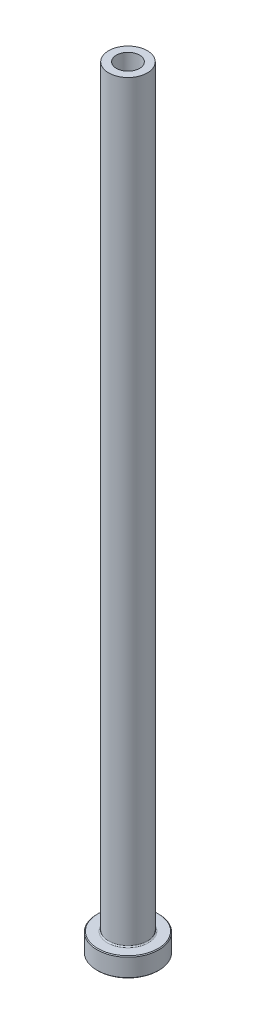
from build123d import *

# Parameters (mm, degrees)
FILLET1_R     = 0.3
CHAMFER1_SIZE = 0.2
CHAMFER3_SIZE = 0.5


with BuildPart() as part:
    # Sketch1 → Revolve1 (revolve)
    with BuildSketch(Plane.XY, mode=Mode.PRIVATE) as revolve1_sk:
        Polygon((-3, 200), (-5, 200), (-5, 5), (-8, 5), (-8, 0), (-3.25, 0), (-3.25, 143), (-3, 155), align=None)
    revolve(revolve1_sk.sketch.rotate(Axis((0, 92.187680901, 0), (0, -1, 0)), 270), axis=Axis((0, 92.187680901, 0), (0, -1, 0)))

    # Fillet1
    fillet1_edges = [part.edges().sort_by_distance(p)[0] for p in [
        (0, 5, -5),
    ]]
    fillet(fillet1_edges, radius=FILLET1_R)

    # Chamfer1
    chamfer1_edges = [part.edges().sort_by_distance(p)[0] for p in [
        (0, 0, -8),
        (0, 5, -8),
    ]]
    chamfer(chamfer1_edges, length=CHAMFER1_SIZE)

    # Chamfer3
    chamfer3_edges = [part.edges().sort_by_distance(p)[0] for p in [
        (0, 0, -3.25),
    ]]
    chamfer(chamfer3_edges, length=CHAMFER3_SIZE)


solid = part.part
